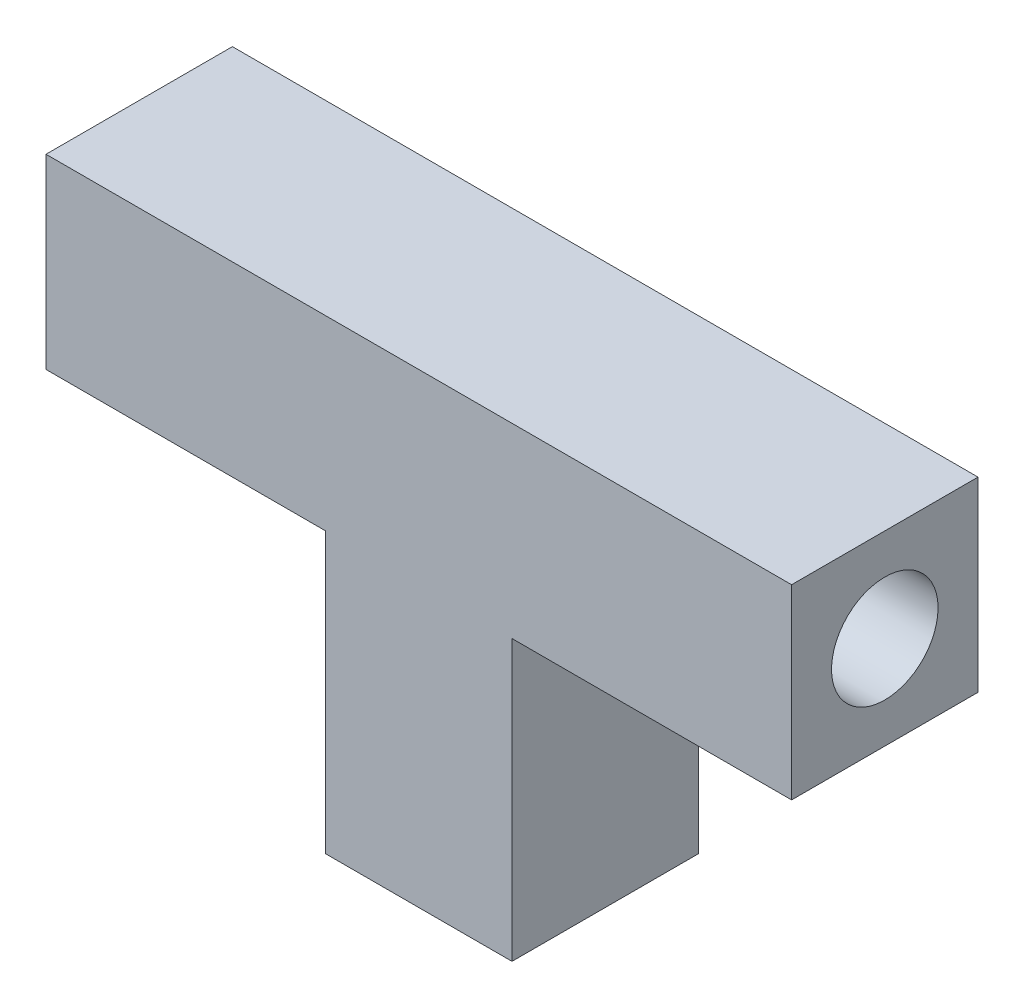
from build123d import *

# Parameters (mm, degrees)
BOSS_EXTRUDE1_DEPTH     = 1.75
CUT_EXTRUDE1_DEPTH      = 11.052984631
CUT_EXTRUDE1_DEPTH_BACK = 11.052984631
SKETCH2_R               = 1
SKETCH3_R               = 1
CUT_EXTRUDE2_DEPTH      = 7


with BuildPart() as part:
    # Sketch1 → Boss-Extrude1 (new, symmetric)
    with BuildSketch(Plane.XY):
        Polygon((-7, 1.75), (7, 1.75), (7, -1.75), (1.75, -1.75), (1.75, -7), (-1.75, -7), (-1.75, -1.75), (-7, -1.75), align=None)
    extrude(amount=BOSS_EXTRUDE1_DEPTH, both=True)

    # Sketch2 → Cut-Extrude1 (cut, two sides: drawn at the far end of the back side and taken through both)
    with BuildSketch(Plane(origin=(0, 0, 0), x_dir=(0, 0, -1), z_dir=(1, 0, 0)).offset(-CUT_EXTRUDE1_DEPTH_BACK)):
        Circle(SKETCH2_R)
    extrude(amount=CUT_EXTRUDE1_DEPTH + CUT_EXTRUDE1_DEPTH_BACK, mode=Mode.SUBTRACT)

    # Sketch3 → Cut-Extrude2 (cut)
    with BuildSketch(Plane(origin=(0, 0, 0), x_dir=(1, 0, 0), z_dir=(0, 1, 0))):
        with Locations(Location((0, 0, 0), (0, 0, 270))):
            Circle(SKETCH3_R)
    extrude(amount=-CUT_EXTRUDE2_DEPTH, mode=Mode.SUBTRACT)


solid = part.part
